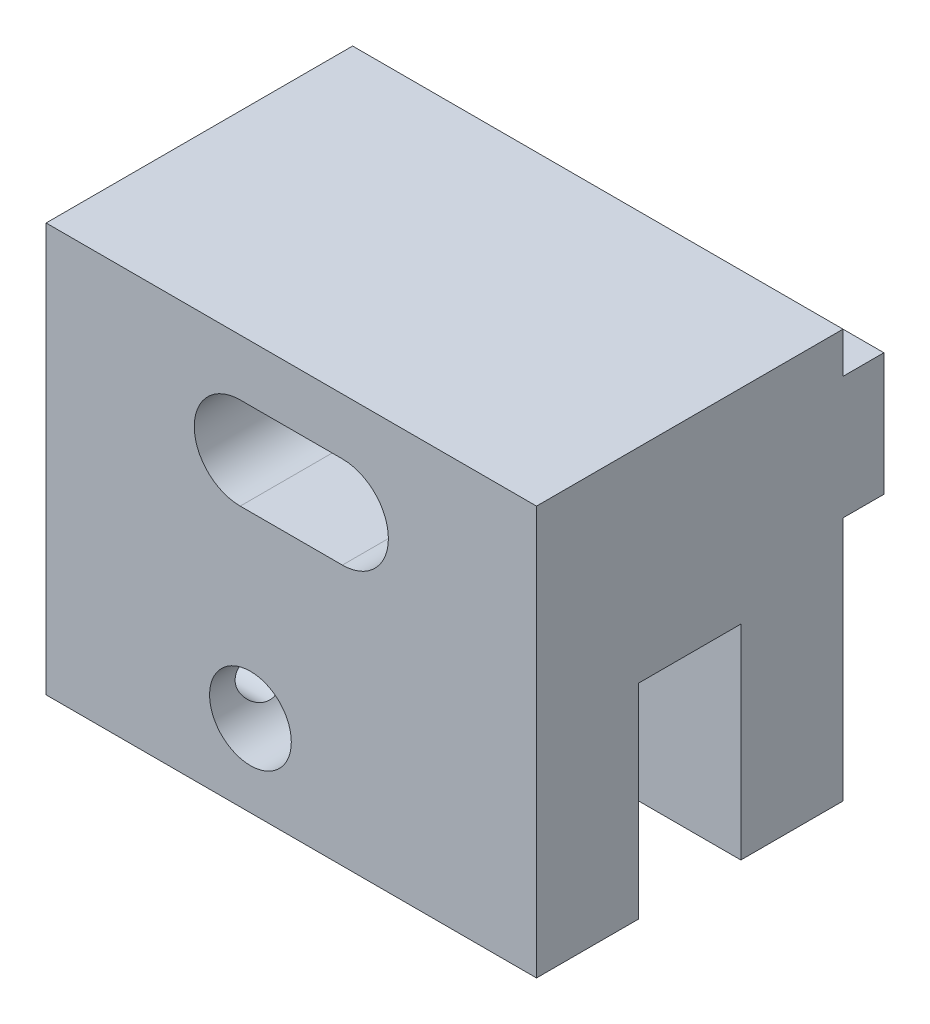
ISO-10303-21;
HEADER;
FILE_DESCRIPTION(('STEP AP214'),'2;1');
FILE_NAME('part.step','',(''),(''),'','','');
FILE_SCHEMA(('AUTOMOTIVE_DESIGN { 1 0 10303 214 1 1 1 1 }'));
ENDSEC;
DATA;
#1=APPLICATION_CONTEXT('core data for automotive mechanical design processes');
#2=APPLICATION_PROTOCOL_DEFINITION('international standard','automotive_design',2000,#1);
#3=PRODUCT_CONTEXT('',#1,'mechanical');
#4=PRODUCT('Part','Part','',(#3));
#5=PRODUCT_RELATED_PRODUCT_CATEGORY('part','',(#4));
#6=PRODUCT_DEFINITION_FORMATION('','',#4);
#7=PRODUCT_DEFINITION_CONTEXT('part definition',#1,'design');
#8=PRODUCT_DEFINITION('design','',#6,#7);
#9=PRODUCT_DEFINITION_SHAPE('','',#8);
#10=(LENGTH_UNIT() NAMED_UNIT(*) SI_UNIT(.MILLI.,.METRE.));
#11=(NAMED_UNIT(*) PLANE_ANGLE_UNIT() SI_UNIT($,.RADIAN.));
#12=(NAMED_UNIT(*) SI_UNIT($,.STERADIAN.) SOLID_ANGLE_UNIT());
#13=UNCERTAINTY_MEASURE_WITH_UNIT(LENGTH_MEASURE(1.E-05),#10,'distance_accuracy_value','');
#14=(GEOMETRIC_REPRESENTATION_CONTEXT(3) GLOBAL_UNCERTAINTY_ASSIGNED_CONTEXT((#13)) GLOBAL_UNIT_ASSIGNED_CONTEXT((#10,
#11,#12)) REPRESENTATION_CONTEXT('',''));
#15=CARTESIAN_POINT('',(0.,0.,0.));
#16=DIRECTION('',(0.,0.,1.));
#17=DIRECTION('',(1.,0.,0.));
#18=AXIS2_PLACEMENT_3D('',#15,#16,#17);
#19=CARTESIAN_POINT('',(0.,20.,0.));
#20=DIRECTION('',(0.,0.,-1.));
#21=DIRECTION('',(-1.,0.,0.));
#22=AXIS2_PLACEMENT_3D('',#19,#20,#21);
#23=PLANE('',#22);
#24=DIRECTION('',(-1.,0.,0.));
#25=VECTOR('',#24,1.);
#26=CARTESIAN_POINT('',(14.5,17.25,0.));
#27=LINE('',#26,#25);
#28=CARTESIAN_POINT('',(14.5,17.25,0.));
#29=VERTEX_POINT('',#28);
#30=CARTESIAN_POINT('',(9.5,17.25,0.));
#31=VERTEX_POINT('',#30);
#32=EDGE_CURVE('E230',#29,#31,#27,.T.);
#33=ORIENTED_EDGE('',*,*,#32,.T.);
#34=CARTESIAN_POINT('',(9.5,15.,0.));
#35=DIRECTION('',(0.,0.,1.));
#36=DIRECTION('',(1.,0.,0.));
#37=AXIS2_PLACEMENT_3D('',#34,#35,#36);
#38=CIRCLE('',#37,2.25);
#39=CARTESIAN_POINT('',(9.5,12.75,0.));
#40=VERTEX_POINT('',#39);
#41=EDGE_CURVE('E213',#31,#40,#38,.T.);
#42=ORIENTED_EDGE('',*,*,#41,.T.);
#43=DIRECTION('',(1.,0.,0.));
#44=VECTOR('',#43,1.);
#45=CARTESIAN_POINT('',(9.5,12.75,0.));
#46=LINE('',#45,#44);
#47=CARTESIAN_POINT('',(14.5,12.75,0.));
#48=VERTEX_POINT('',#47);
#49=EDGE_CURVE('E217',#40,#48,#46,.T.);
#50=ORIENTED_EDGE('',*,*,#49,.T.);
#51=CARTESIAN_POINT('',(14.5,15.,0.));
#52=DIRECTION('',(0.,0.,1.));
#53=DIRECTION('',(1.,0.,0.));
#54=AXIS2_PLACEMENT_3D('',#51,#52,#53);
#55=CIRCLE('',#54,2.25);
#56=EDGE_CURVE('E222',#48,#29,#55,.T.);
#57=ORIENTED_EDGE('',*,*,#56,.T.);
#58=EDGE_LOOP('',(#33,#42,#50,#57));
#59=FACE_BOUND('',#58,.T.);
#60=DIRECTION('',(0.,-1.,0.));
#61=VECTOR('',#60,1.);
#62=CARTESIAN_POINT('',(0.,0.,0.));
#63=LINE('',#62,#61);
#64=CARTESIAN_POINT('',(0.,17.9999999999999,0.));
#65=VERTEX_POINT('',#64);
#66=CARTESIAN_POINT('',(0.,11.9999999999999,0.));
#67=VERTEX_POINT('',#66);
#68=EDGE_CURVE('E188',#65,#67,#63,.T.);
#69=ORIENTED_EDGE('',*,*,#68,.F.);
#70=DIRECTION('',(1.,0.,0.));
#71=VECTOR('',#70,1.);
#72=CARTESIAN_POINT('',(0.,17.9999999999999,0.));
#73=LINE('',#72,#71);
#74=CARTESIAN_POINT('',(24.,17.9999999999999,0.));
#75=VERTEX_POINT('',#74);
#76=EDGE_CURVE('E315',#65,#75,#73,.T.);
#77=ORIENTED_EDGE('',*,*,#76,.T.);
#78=DIRECTION('',(0.,1.,0.));
#79=VECTOR('',#78,1.);
#80=CARTESIAN_POINT('',(24.,0.,0.));
#81=LINE('',#80,#79);
#82=CARTESIAN_POINT('',(24.,11.9999999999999,0.));
#83=VERTEX_POINT('',#82);
#84=EDGE_CURVE('E185',#83,#75,#81,.T.);
#85=ORIENTED_EDGE('',*,*,#84,.F.);
#86=DIRECTION('',(1.,0.,0.));
#87=VECTOR('',#86,1.);
#88=CARTESIAN_POINT('',(0.,11.9999999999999,0.));
#89=LINE('',#88,#87);
#90=EDGE_CURVE('E318',#67,#83,#89,.T.);
#91=ORIENTED_EDGE('',*,*,#90,.F.);
#92=EDGE_LOOP('',(#69,#77,#85,#91));
#93=FACE_BOUND('',#92,.T.);
#94=ADVANCED_FACE('F33',(#59,#93),#23,.T.);
#95=CARTESIAN_POINT('',(0.,0.,17.));
#96=DIRECTION('',(1.,0.,0.));
#97=DIRECTION('',(0.,0.,-1.));
#98=AXIS2_PLACEMENT_3D('',#95,#96,#97);
#99=PLANE('',#98);
#100=CARTESIAN_POINT('',(0.,3.99999999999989,14.5));
#101=DIRECTION('',(-1.,0.,0.));
#102=DIRECTION('',(0.,0.,1.));
#103=AXIS2_PLACEMENT_3D('',#100,#101,#102);
#104=CIRCLE('',#103,1.25);
#105=CARTESIAN_POINT('',(0.,3.99999999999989,15.75));
#106=VERTEX_POINT('',#105);
#107=EDGE_CURVE('E370',#106,#106,#104,.T.);
#108=ORIENTED_EDGE('',*,*,#107,.F.);
#109=EDGE_LOOP('',(#108));
#110=FACE_BOUND('',#109,.T.);
#111=CARTESIAN_POINT('',(0.,3.99999999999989,4.5));
#112=DIRECTION('',(-1.,0.,0.));
#113=DIRECTION('',(0.,0.,1.));
#114=AXIS2_PLACEMENT_3D('',#111,#112,#113);
#115=CIRCLE('',#114,1.25);
#116=CARTESIAN_POINT('',(0.,3.99999999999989,5.75));
#117=VERTEX_POINT('',#116);
#118=EDGE_CURVE('E369',#117,#117,#115,.T.);
#119=ORIENTED_EDGE('',*,*,#118,.F.);
#120=EDGE_LOOP('',(#119));
#121=FACE_BOUND('',#120,.T.);
#122=DIRECTION('',(0.,1.,0.));
#123=VECTOR('',#122,1.);
#124=CARTESIAN_POINT('',(0.,17.9999999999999,2.));
#125=LINE('',#124,#123);
#126=CARTESIAN_POINT('',(0.,17.9999999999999,2.));
#127=VERTEX_POINT('',#126);
#128=CARTESIAN_POINT('',(0.,20.,2.));
#129=VERTEX_POINT('',#128);
#130=EDGE_CURVE('E159',#127,#129,#125,.T.);
#131=ORIENTED_EDGE('',*,*,#130,.F.);
#132=DIRECTION('',(0.,0.,1.));
#133=VECTOR('',#132,1.);
#134=CARTESIAN_POINT('',(0.,17.9999999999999,2.));
#135=LINE('',#134,#133);
#136=EDGE_CURVE('E574',#65,#127,#135,.T.);
#137=ORIENTED_EDGE('',*,*,#136,.F.);
#138=ORIENTED_EDGE('',*,*,#68,.T.);
#139=DIRECTION('',(0.,0.,-1.));
#140=VECTOR('',#139,1.);
#141=CARTESIAN_POINT('',(0.,11.9999999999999,2.));
#142=LINE('',#141,#140);
#143=CARTESIAN_POINT('',(0.,11.9999999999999,2.));
#144=VERTEX_POINT('',#143);
#145=EDGE_CURVE('E573',#144,#67,#142,.T.);
#146=ORIENTED_EDGE('',*,*,#145,.F.);
#147=DIRECTION('',(0.,1.,0.));
#148=VECTOR('',#147,1.);
#149=CARTESIAN_POINT('',(0.,-1.13686837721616E-13,2.));
#150=LINE('',#149,#148);
#151=CARTESIAN_POINT('',(0.,-1.13686837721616E-13,2.));
#152=VERTEX_POINT('',#151);
#153=EDGE_CURVE('E577',#152,#144,#150,.T.);
#154=ORIENTED_EDGE('',*,*,#153,.F.);
#155=DIRECTION('',(0.,0.,-1.));
#156=VECTOR('',#155,1.);
#157=CARTESIAN_POINT('',(0.,0.,17.));
#158=LINE('',#157,#156);
#159=CARTESIAN_POINT('',(0.,-1.13686837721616E-13,7.));
#160=VERTEX_POINT('',#159);
#161=EDGE_CURVE('E42',#160,#152,#158,.T.);
#162=ORIENTED_EDGE('',*,*,#161,.F.);
#163=DIRECTION('',(0.,-1.,0.));
#164=VECTOR('',#163,1.);
#165=CARTESIAN_POINT('',(0.,-1.13686837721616E-13,7.));
#166=LINE('',#165,#164);
#167=CARTESIAN_POINT('',(0.,9.99999999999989,7.));
#168=VERTEX_POINT('',#167);
#169=EDGE_CURVE('E581',#168,#160,#166,.T.);
#170=ORIENTED_EDGE('',*,*,#169,.F.);
#171=DIRECTION('',(0.,0.,-1.));
#172=VECTOR('',#171,1.);
#173=CARTESIAN_POINT('',(0.,9.99999999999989,12.));
#174=LINE('',#173,#172);
#175=CARTESIAN_POINT('',(0.,9.99999999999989,12.));
#176=VERTEX_POINT('',#175);
#177=EDGE_CURVE('E167',#176,#168,#174,.T.);
#178=ORIENTED_EDGE('',*,*,#177,.F.);
#179=DIRECTION('',(0.,1.,0.));
#180=VECTOR('',#179,1.);
#181=CARTESIAN_POINT('',(0.,-1.13686837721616E-13,12.));
#182=LINE('',#181,#180);
#183=CARTESIAN_POINT('',(0.,-1.13686837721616E-13,12.));
#184=VERTEX_POINT('',#183);
#185=EDGE_CURVE('E151',#184,#176,#182,.T.);
#186=ORIENTED_EDGE('',*,*,#185,.F.);
#187=CARTESIAN_POINT('',(0.,0.,17.));
#188=VERTEX_POINT('',#187);
#189=EDGE_CURVE('E12',#188,#184,#158,.T.);
#190=ORIENTED_EDGE('',*,*,#189,.F.);
#191=DIRECTION('',(0.,-1.,0.));
#192=VECTOR('',#191,1.);
#193=CARTESIAN_POINT('',(0.,0.,17.));
#194=LINE('',#193,#192);
#195=CARTESIAN_POINT('',(0.,20.,17.));
#196=VERTEX_POINT('',#195);
#197=EDGE_CURVE('E177',#196,#188,#194,.T.);
#198=ORIENTED_EDGE('',*,*,#197,.F.);
#199=DIRECTION('',(0.,0.,-1.));
#200=VECTOR('',#199,1.);
#201=CARTESIAN_POINT('',(0.,20.,17.));
#202=LINE('',#201,#200);
#203=EDGE_CURVE('E196',#196,#129,#202,.T.);
#204=ORIENTED_EDGE('',*,*,#203,.T.);
#205=EDGE_LOOP('',(#131,#137,#138,#146,#154,#162,#170,#178,#186,#190,#198,#204));
#206=FACE_BOUND('',#205,.T.);
#207=ADVANCED_FACE('F35',(#110,#121,#206),#99,.F.);
#208=CARTESIAN_POINT('',(0.,0.,17.));
#209=DIRECTION('',(0.,1.,0.));
#210=DIRECTION('',(0.,0.,1.));
#211=AXIS2_PLACEMENT_3D('',#208,#209,#210);
#212=PLANE('',#211);
#213=DIRECTION('',(1.,0.,0.));
#214=VECTOR('',#213,1.);
#215=CARTESIAN_POINT('',(0.,-1.13686837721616E-13,2.));
#216=LINE('',#215,#214);
#217=CARTESIAN_POINT('',(24.,-1.13686837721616E-13,2.));
#218=VERTEX_POINT('',#217);
#219=EDGE_CURVE('E285',#152,#218,#216,.T.);
#220=ORIENTED_EDGE('',*,*,#219,.T.);
#221=DIRECTION('',(0.,0.,-1.));
#222=VECTOR('',#221,1.);
#223=CARTESIAN_POINT('',(24.,0.,17.));
#224=LINE('',#223,#222);
#225=CARTESIAN_POINT('',(24.,-1.13686837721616E-13,7.));
#226=VERTEX_POINT('',#225);
#227=EDGE_CURVE('E203',#226,#218,#224,.T.);
#228=ORIENTED_EDGE('',*,*,#227,.F.);
#229=DIRECTION('',(1.,0.,0.));
#230=VECTOR('',#229,1.);
#231=CARTESIAN_POINT('',(0.,-1.13686837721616E-13,7.));
#232=LINE('',#231,#230);
#233=EDGE_CURVE('E293',#160,#226,#232,.T.);
#234=ORIENTED_EDGE('',*,*,#233,.F.);
#235=ORIENTED_EDGE('',*,*,#161,.T.);
#236=EDGE_LOOP('',(#220,#228,#234,#235));
#237=FACE_BOUND('',#236,.T.);
#238=ADVANCED_FACE('F267',(#237),#212,.F.);
#239=DIRECTION('',(1.,0.,0.));
#240=VECTOR('',#239,1.);
#241=CARTESIAN_POINT('',(0.,-1.13686837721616E-13,12.));
#242=LINE('',#241,#240);
#243=CARTESIAN_POINT('',(24.,-1.14491749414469E-13,12.));
#244=VERTEX_POINT('',#243);
#245=EDGE_CURVE('E148',#184,#244,#242,.T.);
#246=ORIENTED_EDGE('',*,*,#245,.T.);
#247=CARTESIAN_POINT('',(24.,0.,17.));
#248=VERTEX_POINT('',#247);
#249=EDGE_CURVE('E173',#248,#244,#224,.T.);
#250=ORIENTED_EDGE('',*,*,#249,.F.);
#251=DIRECTION('',(1.,0.,0.));
#252=VECTOR('',#251,1.);
#253=CARTESIAN_POINT('',(0.,0.,17.));
#254=LINE('',#253,#252);
#255=EDGE_CURVE('E171',#188,#248,#254,.T.);
#256=ORIENTED_EDGE('',*,*,#255,.F.);
#257=ORIENTED_EDGE('',*,*,#189,.T.);
#258=EDGE_LOOP('',(#246,#250,#256,#257));
#259=FACE_BOUND('',#258,.T.);
#260=ADVANCED_FACE('F170',(#259),#212,.F.);
#261=CARTESIAN_POINT('',(24.,0.,17.));
#262=DIRECTION('',(-1.,0.,0.));
#263=DIRECTION('',(0.,0.,1.));
#264=AXIS2_PLACEMENT_3D('',#261,#262,#263);
#265=PLANE('',#264);
#266=DIRECTION('',(0.,1.,0.));
#267=VECTOR('',#266,1.);
#268=CARTESIAN_POINT('',(24.,17.9999999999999,2.));
#269=LINE('',#268,#267);
#270=CARTESIAN_POINT('',(24.,17.9999999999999,2.));
#271=VERTEX_POINT('',#270);
#272=CARTESIAN_POINT('',(24.,19.9999999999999,2.));
#273=VERTEX_POINT('',#272);
#274=EDGE_CURVE('E168',#271,#273,#269,.T.);
#275=ORIENTED_EDGE('',*,*,#274,.T.);
#276=DIRECTION('',(0.,0.,-1.));
#277=VECTOR('',#276,1.);
#278=CARTESIAN_POINT('',(24.,20.,17.));
#279=LINE('',#278,#277);
#280=CARTESIAN_POINT('',(24.,20.,17.));
#281=VERTEX_POINT('',#280);
#282=EDGE_CURVE('E200',#281,#273,#279,.T.);
#283=ORIENTED_EDGE('',*,*,#282,.F.);
#284=DIRECTION('',(0.,1.,0.));
#285=VECTOR('',#284,1.);
#286=CARTESIAN_POINT('',(24.,0.,17.));
#287=LINE('',#286,#285);
#288=EDGE_CURVE('E176',#248,#281,#287,.T.);
#289=ORIENTED_EDGE('',*,*,#288,.F.);
#290=ORIENTED_EDGE('',*,*,#249,.T.);
#291=DIRECTION('',(0.,1.,0.));
#292=VECTOR('',#291,1.);
#293=CARTESIAN_POINT('',(24.,-1.13686837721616E-13,12.));
#294=LINE('',#293,#292);
#295=CARTESIAN_POINT('',(24.,9.99999999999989,12.));
#296=VERTEX_POINT('',#295);
#297=EDGE_CURVE('E154',#244,#296,#294,.T.);
#298=ORIENTED_EDGE('',*,*,#297,.T.);
#299=DIRECTION('',(0.,0.,-1.));
#300=VECTOR('',#299,1.);
#301=CARTESIAN_POINT('',(24.,9.99999999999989,12.));
#302=LINE('',#301,#300);
#303=CARTESIAN_POINT('',(24.,9.99999999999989,7.));
#304=VERTEX_POINT('',#303);
#305=EDGE_CURVE('E58',#296,#304,#302,.T.);
#306=ORIENTED_EDGE('',*,*,#305,.T.);
#307=DIRECTION('',(0.,-1.,0.));
#308=VECTOR('',#307,1.);
#309=CARTESIAN_POINT('',(24.,-1.13686837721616E-13,7.));
#310=LINE('',#309,#308);
#311=EDGE_CURVE('E300',#304,#226,#310,.T.);
#312=ORIENTED_EDGE('',*,*,#311,.T.);
#313=ORIENTED_EDGE('',*,*,#227,.T.);
#314=DIRECTION('',(0.,1.,0.));
#315=VECTOR('',#314,1.);
#316=CARTESIAN_POINT('',(24.,-1.13686837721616E-13,2.));
#317=LINE('',#316,#315);
#318=CARTESIAN_POINT('',(24.,11.9999999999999,2.));
#319=VERTEX_POINT('',#318);
#320=EDGE_CURVE('E298',#218,#319,#317,.T.);
#321=ORIENTED_EDGE('',*,*,#320,.T.);
#322=DIRECTION('',(0.,0.,-1.));
#323=VECTOR('',#322,1.);
#324=CARTESIAN_POINT('',(24.,11.9999999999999,2.));
#325=LINE('',#324,#323);
#326=EDGE_CURVE('E50',#319,#83,#325,.T.);
#327=ORIENTED_EDGE('',*,*,#326,.T.);
#328=ORIENTED_EDGE('',*,*,#84,.T.);
#329=DIRECTION('',(0.,0.,1.));
#330=VECTOR('',#329,1.);
#331=CARTESIAN_POINT('',(24.,17.9999999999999,2.));
#332=LINE('',#331,#330);
#333=EDGE_CURVE('E308',#75,#271,#332,.T.);
#334=ORIENTED_EDGE('',*,*,#333,.T.);
#335=EDGE_LOOP('',(#275,#283,#289,#290,#298,#306,#312,#313,#321,#327,#328,#334));
#336=FACE_BOUND('',#335,.T.);
#337=ADVANCED_FACE('F273',(#336),#265,.F.);
#338=CARTESIAN_POINT('',(0.,20.,17.));
#339=DIRECTION('',(0.,-1.,0.));
#340=DIRECTION('',(0.,0.,-1.));
#341=AXIS2_PLACEMENT_3D('',#338,#339,#340);
#342=PLANE('',#341);
#343=DIRECTION('',(1.,0.,0.));
#344=VECTOR('',#343,1.);
#345=CARTESIAN_POINT('',(0.,19.9999999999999,2.));
#346=LINE('',#345,#344);
#347=EDGE_CURVE('E208',#129,#273,#346,.T.);
#348=ORIENTED_EDGE('',*,*,#347,.F.);
#349=ORIENTED_EDGE('',*,*,#203,.F.);
#350=DIRECTION('',(-1.,0.,0.));
#351=VECTOR('',#350,1.);
#352=CARTESIAN_POINT('',(0.,20.,17.));
#353=LINE('',#352,#351);
#354=EDGE_CURVE('E182',#281,#196,#353,.T.);
#355=ORIENTED_EDGE('',*,*,#354,.F.);
#356=ORIENTED_EDGE('',*,*,#282,.T.);
#357=EDGE_LOOP('',(#348,#349,#355,#356));
#358=FACE_BOUND('',#357,.T.);
#359=ADVANCED_FACE('F258',(#358),#342,.F.);
#360=CARTESIAN_POINT('',(10.,4.,17.));
#361=DIRECTION('',(0.,0.,-1.));
#362=DIRECTION('',(-1.,0.,0.));
#363=AXIS2_PLACEMENT_3D('',#360,#361,#362);
#364=CYLINDRICAL_SURFACE('',#363,2.);
#365=CARTESIAN_POINT('',(8.,3.99999999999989,15.75));
#366=CARTESIAN_POINT('',(8.00000404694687,4.06351047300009,15.7499956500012));
#367=CARTESIAN_POINT('',(8.00305676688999,4.12709644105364,15.7451269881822));
#368=CARTESIAN_POINT('',(8.01497832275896,4.25231826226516,15.7259141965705));
#369=CARTESIAN_POINT('',(8.02385824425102,4.31395016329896,15.7115520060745));
#370=CARTESIAN_POINT('',(8.04654147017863,4.43320555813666,15.6741886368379));
#371=CARTESIAN_POINT('',(8.06032039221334,4.4908472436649,15.6512302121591));
#372=CARTESIAN_POINT('',(8.09165401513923,4.60126036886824,15.5976141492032));
#373=CARTESIAN_POINT('',(8.10920829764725,4.65403234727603,15.5669573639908));
#374=CARTESIAN_POINT('',(8.14829847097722,4.75797419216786,15.496113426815));
#375=CARTESIAN_POINT('',(8.17004037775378,4.80867956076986,15.4553607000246));
#376=CARTESIAN_POINT('',(8.21468650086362,4.90298637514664,15.3667808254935));
#377=CARTESIAN_POINT('',(8.23759225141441,4.94657810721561,15.3189441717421));
#378=CARTESIAN_POINT('',(8.28569581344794,5.0314287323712,15.2099661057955));
#379=CARTESIAN_POINT('',(8.3107838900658,5.07157206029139,15.1479002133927));
#380=CARTESIAN_POINT('',(8.3566980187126,5.14073966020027,15.0164351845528));
#381=CARTESIAN_POINT('',(8.37753124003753,5.16978270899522,14.9470486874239));
#382=CARTESIAN_POINT('',(8.40690424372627,5.20933400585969,14.8211894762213));
#383=CARTESIAN_POINT('',(8.41723094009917,5.22269552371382,14.7660331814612));
#384=CARTESIAN_POINT('',(8.43218642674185,5.24181843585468,14.6536940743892));
#385=CARTESIAN_POINT('',(8.43682326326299,5.24759056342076,14.5965142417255));
#386=CARTESIAN_POINT('',(8.43970114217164,5.25118918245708,14.4815869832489));
#387=CARTESIAN_POINT('',(8.43792541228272,5.2489948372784,14.4238384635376));
#388=CARTESIAN_POINT('',(8.42822597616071,5.23676317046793,14.309689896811));
#389=CARTESIAN_POINT('',(8.42029734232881,5.22671956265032,14.2532909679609));
#390=CARTESIAN_POINT('',(8.3996742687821,5.19968103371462,14.1445615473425));
#391=CARTESIAN_POINT('',(8.38709284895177,5.18285016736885,14.0921675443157));
#392=CARTESIAN_POINT('',(8.35854433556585,5.14290189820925,13.9908388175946));
#393=CARTESIAN_POINT('',(8.34257604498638,5.11978227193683,13.9419053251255));
#394=CARTESIAN_POINT('',(8.30545184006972,5.06294892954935,13.8391667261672));
#395=CARTESIAN_POINT('',(8.28388408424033,5.02806296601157,13.7861591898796));
#396=CARTESIAN_POINT('',(8.23994288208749,4.95088146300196,13.6861697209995));
#397=CARTESIAN_POINT('',(8.21756862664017,4.90857830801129,13.6391940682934));
#398=CARTESIAN_POINT('',(8.17020105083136,4.80951971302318,13.5446982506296));
#399=CARTESIAN_POINT('',(8.14538468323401,4.75153135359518,13.4983670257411));
#400=CARTESIAN_POINT('',(8.0997194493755,4.62714809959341,13.4161491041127));
#401=CARTESIAN_POINT('',(8.07886902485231,4.56075652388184,13.3802583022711));
#402=CARTESIAN_POINT('',(8.0444662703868,4.42488356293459,13.3222363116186));
#403=CARTESIAN_POINT('',(8.03058023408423,4.35576345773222,13.2994659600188));
#404=CARTESIAN_POINT('',(8.0101507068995,4.21361215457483,13.2662350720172));
#405=CARTESIAN_POINT('',(8.00359682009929,4.14058664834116,13.255757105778));
#406=CARTESIAN_POINT('',(7.99902159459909,4.00451561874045,13.2484341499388));
#407=CARTESIAN_POINT('',(7.9998783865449,3.94159722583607,13.2497968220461));
#408=CARTESIAN_POINT('',(8.00741098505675,3.81702788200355,13.2618828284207));
#409=CARTESIAN_POINT('',(8.0140863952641,3.75537684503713,13.2726055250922));
#410=CARTESIAN_POINT('',(8.03225947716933,3.63747892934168,13.302238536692));
#411=CARTESIAN_POINT('',(8.04355829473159,3.58111499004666,13.3208121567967));
#412=CARTESIAN_POINT('',(8.07004315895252,3.47236171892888,13.3652963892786));
#413=CARTESIAN_POINT('',(8.08522985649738,3.41997305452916,13.3912082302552));
#414=CARTESIAN_POINT('',(8.12009987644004,3.31491594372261,13.4525152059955));
#415=CARTESIAN_POINT('',(8.14008235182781,3.26275303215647,13.4886035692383));
#416=CARTESIAN_POINT('',(8.18193029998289,3.16485735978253,13.5677938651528));
#417=CARTESIAN_POINT('',(8.20379785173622,3.11913184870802,13.6109035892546));
#418=CARTESIAN_POINT('',(8.25094130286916,3.02852580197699,13.7101350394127));
#419=CARTESIAN_POINT('',(8.27625116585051,2.98473148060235,13.7672372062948));
#420=CARTESIAN_POINT('',(8.32433237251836,2.90719648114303,13.8888757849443));
#421=CARTESIAN_POINT('',(8.34710546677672,2.87344884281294,13.953407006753));
#422=CARTESIAN_POINT('',(8.38266469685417,2.8231522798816,14.0746921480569));
#423=CARTESIAN_POINT('',(8.39654363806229,2.80448104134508,14.1302407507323));
#424=CARTESIAN_POINT('',(8.41894969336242,2.77499891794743,14.2443931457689));
#425=CARTESIAN_POINT('',(8.42748516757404,2.76417575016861,14.3029920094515));
#426=CARTESIAN_POINT('',(8.43793675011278,2.75098616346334,14.4220902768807));
#427=CARTESIAN_POINT('',(8.4398149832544,2.74866813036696,14.4825985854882));
#428=CARTESIAN_POINT('',(8.43650936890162,2.75280221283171,14.603130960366));
#429=CARTESIAN_POINT('',(8.43132317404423,2.75925724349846,14.6631548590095));
#430=CARTESIAN_POINT('',(8.41544611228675,2.77961727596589,14.7760297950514));
#431=CARTESIAN_POINT('',(8.40523191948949,2.79288080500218,14.8290693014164));
#432=CARTESIAN_POINT('',(8.38082469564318,2.82582376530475,14.9321350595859));
#433=CARTESIAN_POINT('',(8.36663000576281,2.84550587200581,14.9821600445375));
#434=CARTESIAN_POINT('',(8.3333609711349,2.89397309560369,15.0855967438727));
#435=CARTESIAN_POINT('',(8.31387769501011,2.92366355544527,15.1384502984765));
#436=CARTESIAN_POINT('',(8.2733229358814,2.98999982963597,15.238938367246));
#437=CARTESIAN_POINT('',(8.25225017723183,3.02665126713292,15.2865686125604));
#438=CARTESIAN_POINT('',(8.20598089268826,3.11432977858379,15.3850142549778));
#439=CARTESIAN_POINT('',(8.18079458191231,3.16676632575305,15.4345908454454));
#440=CARTESIAN_POINT('',(8.13301270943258,3.28017755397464,15.5244948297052));
#441=CARTESIAN_POINT('',(8.11041875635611,3.34115748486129,15.5648164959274));
#442=CARTESIAN_POINT('',(8.07013289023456,3.47064460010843,15.6347711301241));
#443=CARTESIAN_POINT('',(8.05244928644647,3.53916427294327,15.6643860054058));
#444=CARTESIAN_POINT('',(8.0241847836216,3.68160528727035,15.7110718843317));
#445=CARTESIAN_POINT('',(8.01357878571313,3.755506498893,15.7281872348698));
#446=CARTESIAN_POINT('',(8.00480527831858,3.85858151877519,15.7422992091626));
#447=CARTESIAN_POINT('',(8.00300827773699,3.88675139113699,15.745181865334));
#448=CARTESIAN_POINT('',(8.00060469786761,3.94327581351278,15.7490332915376));
#449=CARTESIAN_POINT('',(7.99999819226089,3.97163037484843,15.75000194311));
#450=CARTESIAN_POINT('',(8.,3.99999999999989,15.75));
#451=B_SPLINE_CURVE_WITH_KNOTS('',3,(#365,#366,#367,#368,#369,#370,#371,#372,#373,#374,#375,
#376,#377,#378,#379,#380,#381,#382,#383,#384,#385,#386,#387,#388,#389,#390,#391,#392,#393,#394,
#395,#396,#397,#398,#399,#400,#401,#402,#403,#404,#405,#406,#407,#408,#409,#410,#411,#412,#413,
#414,#415,#416,#417,#418,#419,#420,#421,#422,#423,#424,#425,#426,#427,#428,#429,#430,#431,#432,
#433,#434,#435,#436,#437,#438,#439,#440,#441,#442,#443,#444,#445,#446,#447,#448,#449,#450),
.UNSPECIFIED.,.T.,.F.,(4,2,2,2,2,2,2,2,2,2,2,2,2,2,2,2,2,2,2,2,2,2,2,2,2,2,2,2,2,2,2,2,2,2,2,2,
2,2,2,2,2,2,4),(0.,0.190412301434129,0.381187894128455,0.571026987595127,0.760845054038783,
0.965821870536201,1.17107628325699,1.4041297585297,1.63678724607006,1.80912008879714,
1.98120894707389,2.15374823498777,2.32642584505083,2.49515839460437,2.66395067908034,
2.86427450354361,3.06480522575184,3.29842180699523,3.53194640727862,3.75284174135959,
3.97342347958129,4.16127180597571,4.34910733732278,4.52959504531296,4.71011298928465,
4.90885230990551,5.10781368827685,5.33565708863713,5.56334227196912,5.7432994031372,
5.92297427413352,6.10366974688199,6.28442527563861,6.45063169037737,6.61690747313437,
6.80725523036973,6.99775741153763,7.22600539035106,7.45439424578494,7.68316725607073,
7.91112460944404,7.99617501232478,8.08123067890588),.UNSPECIFIED.);
#452=CARTESIAN_POINT('',(8.,3.99999999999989,15.75));
#453=VERTEX_POINT('',#452);
#454=EDGE_CURVE('E375',#453,#453,#451,.T.);
#455=ORIENTED_EDGE('',*,*,#454,.T.);
#456=EDGE_LOOP('',(#455));
#457=FACE_BOUND('',#456,.T.);
#458=CARTESIAN_POINT('',(10.,4.,17.));
#459=DIRECTION('',(0.,0.,1.));
#460=DIRECTION('',(1.,0.,0.));
#461=AXIS2_PLACEMENT_3D('',#458,#459,#460);
#462=CIRCLE('',#461,2.);
#463=CARTESIAN_POINT('',(12.,4.,17.));
#464=VERTEX_POINT('',#463);
#465=EDGE_CURVE('E191',#464,#464,#462,.T.);
#466=ORIENTED_EDGE('',*,*,#465,.T.);
#467=EDGE_LOOP('',(#466));
#468=FACE_BOUND('',#467,.T.);
#469=CARTESIAN_POINT('',(10.,4.,12.));
#470=DIRECTION('',(0.,0.,-1.));
#471=DIRECTION('',(-1.,0.,0.));
#472=AXIS2_PLACEMENT_3D('',#469,#470,#471);
#473=CIRCLE('',#472,2.);
#474=CARTESIAN_POINT('',(8.,4.,12.));
#475=VERTEX_POINT('',#474);
#476=EDGE_CURVE('E205',#475,#475,#473,.T.);
#477=ORIENTED_EDGE('',*,*,#476,.T.);
#478=EDGE_LOOP('',(#477));
#479=FACE_BOUND('',#478,.T.);
#480=ADVANCED_FACE('F246',(#457,#468,#479),#364,.F.);
#481=CARTESIAN_POINT('',(0.,20.,17.));
#482=DIRECTION('',(0.,0.,-1.));
#483=DIRECTION('',(-1.,0.,0.));
#484=AXIS2_PLACEMENT_3D('',#481,#482,#483);
#485=PLANE('',#484);
#486=ORIENTED_EDGE('',*,*,#465,.F.);
#487=EDGE_LOOP('',(#486));
#488=FACE_BOUND('',#487,.T.);
#489=ORIENTED_EDGE('',*,*,#197,.T.);
#490=ORIENTED_EDGE('',*,*,#255,.T.);
#491=ORIENTED_EDGE('',*,*,#288,.T.);
#492=ORIENTED_EDGE('',*,*,#354,.T.);
#493=EDGE_LOOP('',(#489,#490,#491,#492));
#494=FACE_BOUND('',#493,.T.);
#495=CARTESIAN_POINT('',(9.5,15.,17.));
#496=DIRECTION('',(0.,0.,1.));
#497=DIRECTION('',(1.,0.,0.));
#498=AXIS2_PLACEMENT_3D('',#495,#496,#497);
#499=CIRCLE('',#498,2.25);
#500=CARTESIAN_POINT('',(9.5,17.25,17.));
#501=VERTEX_POINT('',#500);
#502=CARTESIAN_POINT('',(9.5,12.75,17.));
#503=VERTEX_POINT('',#502);
#504=EDGE_CURVE('E232',#501,#503,#499,.T.);
#505=ORIENTED_EDGE('',*,*,#504,.F.);
#506=DIRECTION('',(-1.,0.,0.));
#507=VECTOR('',#506,1.);
#508=CARTESIAN_POINT('',(14.5,17.25,17.));
#509=LINE('',#508,#507);
#510=CARTESIAN_POINT('',(14.5,17.25,17.));
#511=VERTEX_POINT('',#510);
#512=EDGE_CURVE('E225',#511,#501,#509,.T.);
#513=ORIENTED_EDGE('',*,*,#512,.F.);
#514=CARTESIAN_POINT('',(14.5,15.,17.));
#515=DIRECTION('',(0.,0.,1.));
#516=DIRECTION('',(1.,0.,0.));
#517=AXIS2_PLACEMENT_3D('',#514,#515,#516);
#518=CIRCLE('',#517,2.25);
#519=CARTESIAN_POINT('',(14.5,12.75,17.));
#520=VERTEX_POINT('',#519);
#521=EDGE_CURVE('E327',#520,#511,#518,.T.);
#522=ORIENTED_EDGE('',*,*,#521,.F.);
#523=DIRECTION('',(1.,0.,0.));
#524=VECTOR('',#523,1.);
#525=CARTESIAN_POINT('',(9.5,12.75,17.));
#526=LINE('',#525,#524);
#527=EDGE_CURVE('E326',#503,#520,#526,.T.);
#528=ORIENTED_EDGE('',*,*,#527,.F.);
#529=EDGE_LOOP('',(#505,#513,#522,#528));
#530=FACE_BOUND('',#529,.T.);
#531=ADVANCED_FACE('F179',(#488,#494,#530),#485,.F.);
#532=CARTESIAN_POINT('',(9.5,15.,17.));
#533=DIRECTION('',(0.,0.,-1.));
#534=DIRECTION('',(-1.,0.,0.));
#535=AXIS2_PLACEMENT_3D('',#532,#533,#534);
#536=CYLINDRICAL_SURFACE('',#535,2.25);
#537=ORIENTED_EDGE('',*,*,#41,.F.);
#538=DIRECTION('',(0.,0.,-1.));
#539=VECTOR('',#538,1.);
#540=CARTESIAN_POINT('',(9.5,17.25,17.));
#541=LINE('',#540,#539);
#542=EDGE_CURVE('E233',#501,#31,#541,.T.);
#543=ORIENTED_EDGE('',*,*,#542,.F.);
#544=ORIENTED_EDGE('',*,*,#504,.T.);
#545=DIRECTION('',(0.,0.,-1.));
#546=VECTOR('',#545,1.);
#547=CARTESIAN_POINT('',(9.5,12.75,17.));
#548=LINE('',#547,#546);
#549=EDGE_CURVE('E239',#503,#40,#548,.T.);
#550=ORIENTED_EDGE('',*,*,#549,.T.);
#551=EDGE_LOOP('',(#537,#543,#544,#550));
#552=FACE_BOUND('',#551,.T.);
#553=ADVANCED_FACE('F250',(#552),#536,.F.);
#554=CARTESIAN_POINT('',(9.5,12.75,17.));
#555=DIRECTION('',(0.,1.,0.));
#556=DIRECTION('',(0.,0.,1.));
#557=AXIS2_PLACEMENT_3D('',#554,#555,#556);
#558=PLANE('',#557);
#559=ORIENTED_EDGE('',*,*,#49,.F.);
#560=ORIENTED_EDGE('',*,*,#549,.F.);
#561=ORIENTED_EDGE('',*,*,#527,.T.);
#562=DIRECTION('',(0.,0.,-1.));
#563=VECTOR('',#562,1.);
#564=CARTESIAN_POINT('',(14.5,12.75,17.));
#565=LINE('',#564,#563);
#566=EDGE_CURVE('E238',#520,#48,#565,.T.);
#567=ORIENTED_EDGE('',*,*,#566,.T.);
#568=EDGE_LOOP('',(#559,#560,#561,#567));
#569=FACE_BOUND('',#568,.T.);
#570=ADVANCED_FACE('F256',(#569),#558,.T.);
#571=CARTESIAN_POINT('',(14.5,15.,17.));
#572=DIRECTION('',(0.,0.,-1.));
#573=DIRECTION('',(-1.,0.,0.));
#574=AXIS2_PLACEMENT_3D('',#571,#572,#573);
#575=CYLINDRICAL_SURFACE('',#574,2.25);
#576=ORIENTED_EDGE('',*,*,#56,.F.);
#577=ORIENTED_EDGE('',*,*,#566,.F.);
#578=ORIENTED_EDGE('',*,*,#521,.T.);
#579=DIRECTION('',(0.,0.,-1.));
#580=VECTOR('',#579,1.);
#581=CARTESIAN_POINT('',(14.5,17.25,17.));
#582=LINE('',#581,#580);
#583=EDGE_CURVE('E236',#511,#29,#582,.T.);
#584=ORIENTED_EDGE('',*,*,#583,.T.);
#585=EDGE_LOOP('',(#576,#577,#578,#584));
#586=FACE_BOUND('',#585,.T.);
#587=ADVANCED_FACE('F341',(#586),#575,.F.);
#588=CARTESIAN_POINT('',(14.5,17.25,17.));
#589=DIRECTION('',(0.,-1.,0.));
#590=DIRECTION('',(0.,0.,-1.));
#591=AXIS2_PLACEMENT_3D('',#588,#589,#590);
#592=PLANE('',#591);
#593=ORIENTED_EDGE('',*,*,#32,.F.);
#594=ORIENTED_EDGE('',*,*,#583,.F.);
#595=ORIENTED_EDGE('',*,*,#512,.T.);
#596=ORIENTED_EDGE('',*,*,#542,.T.);
#597=EDGE_LOOP('',(#593,#594,#595,#596));
#598=FACE_BOUND('',#597,.T.);
#599=ADVANCED_FACE('F336',(#598),#592,.T.);
#600=CARTESIAN_POINT('',(0.,-1.13686837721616E-13,12.));
#601=DIRECTION('',(0.,0.,-1.));
#602=DIRECTION('',(-1.,0.,0.));
#603=AXIS2_PLACEMENT_3D('',#600,#601,#602);
#604=PLANE('',#603);
#605=ORIENTED_EDGE('',*,*,#476,.F.);
#606=EDGE_LOOP('',(#605));
#607=FACE_BOUND('',#606,.T.);
#608=ORIENTED_EDGE('',*,*,#297,.F.);
#609=ORIENTED_EDGE('',*,*,#245,.F.);
#610=ORIENTED_EDGE('',*,*,#185,.T.);
#611=DIRECTION('',(1.,0.,0.));
#612=VECTOR('',#611,1.);
#613=CARTESIAN_POINT('',(0.,9.99999999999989,12.));
#614=LINE('',#613,#612);
#615=EDGE_CURVE('E158',#176,#296,#614,.T.);
#616=ORIENTED_EDGE('',*,*,#615,.T.);
#617=EDGE_LOOP('',(#608,#609,#610,#616));
#618=FACE_BOUND('',#617,.T.);
#619=ADVANCED_FACE('F150',(#607,#618),#604,.T.);
#620=CARTESIAN_POINT('',(0.,-1.13686837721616E-13,7.));
#621=DIRECTION('',(0.,0.,1.));
#622=DIRECTION('',(1.,0.,0.));
#623=AXIS2_PLACEMENT_3D('',#620,#621,#622);
#624=PLANE('',#623);
#625=CARTESIAN_POINT('',(10.,4.,7.));
#626=DIRECTION('',(0.,0.,1.));
#627=DIRECTION('',(1.,0.,0.));
#628=AXIS2_PLACEMENT_3D('',#625,#626,#627);
#629=CIRCLE('',#628,2.);
#630=CARTESIAN_POINT('',(12.,4.,7.));
#631=VERTEX_POINT('',#630);
#632=EDGE_CURVE('E207',#631,#631,#629,.T.);
#633=ORIENTED_EDGE('',*,*,#632,.F.);
#634=EDGE_LOOP('',(#633));
#635=FACE_BOUND('',#634,.T.);
#636=ORIENTED_EDGE('',*,*,#311,.F.);
#637=DIRECTION('',(1.,0.,0.));
#638=VECTOR('',#637,1.);
#639=CARTESIAN_POINT('',(0.,9.99999999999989,7.));
#640=LINE('',#639,#638);
#641=EDGE_CURVE('E322',#168,#304,#640,.T.);
#642=ORIENTED_EDGE('',*,*,#641,.F.);
#643=ORIENTED_EDGE('',*,*,#169,.T.);
#644=ORIENTED_EDGE('',*,*,#233,.T.);
#645=EDGE_LOOP('',(#636,#642,#643,#644));
#646=FACE_BOUND('',#645,.T.);
#647=ADVANCED_FACE('F362',(#635,#646),#624,.T.);
#648=CARTESIAN_POINT('',(0.,9.99999999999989,12.));
#649=DIRECTION('',(0.,-1.,0.));
#650=DIRECTION('',(0.,0.,-1.));
#651=AXIS2_PLACEMENT_3D('',#648,#649,#650);
#652=PLANE('',#651);
#653=CARTESIAN_POINT('',(20.,9.99999999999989,9.5));
#654=DIRECTION('',(0.,-1.,0.));
#655=DIRECTION('',(0.,0.,-1.));
#656=AXIS2_PLACEMENT_3D('',#653,#654,#655);
#657=CIRCLE('',#656,1.75);
#658=CARTESIAN_POINT('',(20.,9.99999999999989,7.75));
#659=VERTEX_POINT('',#658);
#660=EDGE_CURVE('E401',#659,#659,#657,.T.);
#661=ORIENTED_EDGE('',*,*,#660,.F.);
#662=EDGE_LOOP('',(#661));
#663=FACE_BOUND('',#662,.T.);
#664=ORIENTED_EDGE('',*,*,#305,.F.);
#665=ORIENTED_EDGE('',*,*,#615,.F.);
#666=ORIENTED_EDGE('',*,*,#177,.T.);
#667=ORIENTED_EDGE('',*,*,#641,.T.);
#668=EDGE_LOOP('',(#664,#665,#666,#667));
#669=FACE_BOUND('',#668,.T.);
#670=ADVANCED_FACE('F353',(#663,#669),#652,.T.);
#671=CARTESIAN_POINT('',(8.,3.99999999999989,5.75));
#672=CARTESIAN_POINT('',(8.00000404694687,4.06351047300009,5.74999565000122));
#673=CARTESIAN_POINT('',(8.00305676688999,4.12709644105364,5.74512698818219));
#674=CARTESIAN_POINT('',(8.01497832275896,4.25231826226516,5.7259141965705));
#675=CARTESIAN_POINT('',(8.02385824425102,4.31395016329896,5.71155200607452));
#676=CARTESIAN_POINT('',(8.04654147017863,4.43320555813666,5.67418863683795));
#677=CARTESIAN_POINT('',(8.06032039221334,4.4908472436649,5.65123021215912));
#678=CARTESIAN_POINT('',(8.09165401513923,4.60126036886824,5.59761414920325));
#679=CARTESIAN_POINT('',(8.10920829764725,4.65403234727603,5.56695736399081));
#680=CARTESIAN_POINT('',(8.14829847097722,4.75797419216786,5.49611342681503));
#681=CARTESIAN_POINT('',(8.17004037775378,4.80867956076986,5.45536070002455));
#682=CARTESIAN_POINT('',(8.21468650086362,4.90298637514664,5.36678082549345));
#683=CARTESIAN_POINT('',(8.23759225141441,4.94657810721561,5.31894417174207));
#684=CARTESIAN_POINT('',(8.28569581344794,5.0314287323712,5.20996610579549));
#685=CARTESIAN_POINT('',(8.3107838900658,5.07157206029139,5.14790021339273));
#686=CARTESIAN_POINT('',(8.35669801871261,5.14073966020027,5.01643518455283));
#687=CARTESIAN_POINT('',(8.37753124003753,5.16978270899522,4.94704868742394));
#688=CARTESIAN_POINT('',(8.40690424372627,5.20933400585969,4.8211894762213));
#689=CARTESIAN_POINT('',(8.41723094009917,5.22269552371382,4.7660331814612));
#690=CARTESIAN_POINT('',(8.43218642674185,5.24181843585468,4.65369407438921));
#691=CARTESIAN_POINT('',(8.43682326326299,5.24759056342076,4.59651424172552));
#692=CARTESIAN_POINT('',(8.43970114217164,5.25118918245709,4.48158698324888));
#693=CARTESIAN_POINT('',(8.43792541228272,5.2489948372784,4.4238384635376));
#694=CARTESIAN_POINT('',(8.42822597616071,5.23676317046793,4.30968989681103));
#695=CARTESIAN_POINT('',(8.42029734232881,5.22671956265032,4.25329096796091));
#696=CARTESIAN_POINT('',(8.3996742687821,5.19968103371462,4.14456154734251));
#697=CARTESIAN_POINT('',(8.38709284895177,5.18285016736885,4.09216754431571));
#698=CARTESIAN_POINT('',(8.35854433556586,5.14290189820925,3.99083881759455));
#699=CARTESIAN_POINT('',(8.34257604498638,5.11978227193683,3.94190532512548));
#700=CARTESIAN_POINT('',(8.30545184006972,5.06294892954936,3.83916672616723));
#701=CARTESIAN_POINT('',(8.28388408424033,5.02806296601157,3.78615918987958));
#702=CARTESIAN_POINT('',(8.23994288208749,4.95088146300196,3.68616972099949));
#703=CARTESIAN_POINT('',(8.21756862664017,4.90857830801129,3.63919406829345));
#704=CARTESIAN_POINT('',(8.17020105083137,4.80951971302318,3.54469825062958));
#705=CARTESIAN_POINT('',(8.14538468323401,4.75153135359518,3.49836702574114));
#706=CARTESIAN_POINT('',(8.0997194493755,4.62714809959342,3.41614910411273));
#707=CARTESIAN_POINT('',(8.07886902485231,4.56075652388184,3.38025830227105));
#708=CARTESIAN_POINT('',(8.0444662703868,4.42488356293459,3.32223631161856));
#709=CARTESIAN_POINT('',(8.03058023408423,4.35576345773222,3.2994659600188));
#710=CARTESIAN_POINT('',(8.0101507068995,4.21361215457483,3.26623507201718));
#711=CARTESIAN_POINT('',(8.00359682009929,4.14058664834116,3.25575710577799));
#712=CARTESIAN_POINT('',(7.99902159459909,4.00451561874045,3.2484341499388));
#713=CARTESIAN_POINT('',(7.9998783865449,3.94159722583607,3.24979682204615));
#714=CARTESIAN_POINT('',(8.00741098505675,3.81702788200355,3.26188282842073));
#715=CARTESIAN_POINT('',(8.0140863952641,3.75537684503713,3.27260552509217));
#716=CARTESIAN_POINT('',(8.03225947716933,3.63747892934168,3.30223853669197));
#717=CARTESIAN_POINT('',(8.04355829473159,3.58111499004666,3.32081215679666));
#718=CARTESIAN_POINT('',(8.07004315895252,3.47236171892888,3.36529638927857));
#719=CARTESIAN_POINT('',(8.08522985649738,3.41997305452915,3.39120823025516));
#720=CARTESIAN_POINT('',(8.12009987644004,3.31491594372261,3.45251520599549));
#721=CARTESIAN_POINT('',(8.14008235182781,3.26275303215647,3.48860356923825));
#722=CARTESIAN_POINT('',(8.18193029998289,3.16485735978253,3.56779386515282));
#723=CARTESIAN_POINT('',(8.20379785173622,3.11913184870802,3.61090358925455));
#724=CARTESIAN_POINT('',(8.25094130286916,3.02852580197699,3.71013503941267));
#725=CARTESIAN_POINT('',(8.27625116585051,2.98473148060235,3.76723720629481));
#726=CARTESIAN_POINT('',(8.32433237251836,2.90719648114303,3.88887578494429));
#727=CARTESIAN_POINT('',(8.34710546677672,2.87344884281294,3.95340700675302));
#728=CARTESIAN_POINT('',(8.38266469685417,2.82315227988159,4.07469214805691));
#729=CARTESIAN_POINT('',(8.3965436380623,2.80448104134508,4.13024075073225));
#730=CARTESIAN_POINT('',(8.41894969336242,2.77499891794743,4.24439314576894));
#731=CARTESIAN_POINT('',(8.42748516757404,2.76417575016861,4.30299200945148));
#732=CARTESIAN_POINT('',(8.43793675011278,2.75098616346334,4.4220902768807));
#733=CARTESIAN_POINT('',(8.4398149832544,2.74866813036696,4.48259858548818));
#734=CARTESIAN_POINT('',(8.43650936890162,2.75280221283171,4.60313096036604));
#735=CARTESIAN_POINT('',(8.43132317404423,2.75925724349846,4.66315485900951));
#736=CARTESIAN_POINT('',(8.41544611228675,2.77961727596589,4.77602979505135));
#737=CARTESIAN_POINT('',(8.40523191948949,2.79288080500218,4.8290693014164));
#738=CARTESIAN_POINT('',(8.38082469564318,2.82582376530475,4.93213505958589));
#739=CARTESIAN_POINT('',(8.36663000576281,2.84550587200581,4.98216004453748));
#740=CARTESIAN_POINT('',(8.3333609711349,2.89397309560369,5.08559674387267));
#741=CARTESIAN_POINT('',(8.31387769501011,2.92366355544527,5.13845029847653));
#742=CARTESIAN_POINT('',(8.2733229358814,2.98999982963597,5.23893836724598));
#743=CARTESIAN_POINT('',(8.25225017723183,3.02665126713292,5.28656861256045));
#744=CARTESIAN_POINT('',(8.20598089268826,3.11432977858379,5.38501425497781));
#745=CARTESIAN_POINT('',(8.18079458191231,3.16676632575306,5.43459084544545));
#746=CARTESIAN_POINT('',(8.13301270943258,3.28017755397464,5.52449482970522));
#747=CARTESIAN_POINT('',(8.11041875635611,3.34115748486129,5.56481649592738));
#748=CARTESIAN_POINT('',(8.07013289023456,3.47064460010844,5.63477113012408));
#749=CARTESIAN_POINT('',(8.05244928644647,3.53916427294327,5.66438600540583));
#750=CARTESIAN_POINT('',(8.0241847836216,3.68160528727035,5.71107188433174));
#751=CARTESIAN_POINT('',(8.01357878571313,3.755506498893,5.72818723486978));
#752=CARTESIAN_POINT('',(8.00480527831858,3.8585815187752,5.74229920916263));
#753=CARTESIAN_POINT('',(8.00300827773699,3.886751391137,5.74518186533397));
#754=CARTESIAN_POINT('',(8.00060469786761,3.94327581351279,5.7490332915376));
#755=CARTESIAN_POINT('',(7.99999819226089,3.97163037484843,5.75000194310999));
#756=CARTESIAN_POINT('',(8.,3.99999999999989,5.75));
#757=B_SPLINE_CURVE_WITH_KNOTS('',3,(#671,#672,#673,#674,#675,#676,#677,#678,#679,#680,#681,
#682,#683,#684,#685,#686,#687,#688,#689,#690,#691,#692,#693,#694,#695,#696,#697,#698,#699,#700,
#701,#702,#703,#704,#705,#706,#707,#708,#709,#710,#711,#712,#713,#714,#715,#716,#717,#718,#719,
#720,#721,#722,#723,#724,#725,#726,#727,#728,#729,#730,#731,#732,#733,#734,#735,#736,#737,#738,
#739,#740,#741,#742,#743,#744,#745,#746,#747,#748,#749,#750,#751,#752,#753,#754,#755,#756),
.UNSPECIFIED.,.T.,.F.,(4,2,2,2,2,2,2,2,2,2,2,2,2,2,2,2,2,2,2,2,2,2,2,2,2,2,2,2,2,2,2,2,2,2,2,2,
2,2,2,2,2,2,4),(0.,0.19041230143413,0.381187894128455,0.571026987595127,0.760845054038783,
0.965821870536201,1.17107628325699,1.4041297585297,1.63678724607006,1.80912008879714,
1.98120894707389,2.15374823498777,2.32642584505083,2.49515839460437,2.66395067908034,
2.86427450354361,3.06480522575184,3.29842180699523,3.53194640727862,3.75284174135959,
3.9734234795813,4.16127180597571,4.34910733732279,4.52959504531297,4.71011298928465,
4.90885230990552,5.10781368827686,5.33565708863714,5.56334227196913,5.74329940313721,
5.92297427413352,6.10366974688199,6.28442527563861,6.45063169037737,6.61690747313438,
6.80725523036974,6.99775741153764,7.22600539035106,7.45439424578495,7.68316725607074,
7.91112460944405,7.99617501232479,8.08123067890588),.UNSPECIFIED.);
#758=CARTESIAN_POINT('',(8.,3.99999999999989,5.75));
#759=VERTEX_POINT('',#758);
#760=EDGE_CURVE('E367',#759,#759,#757,.T.);
#761=ORIENTED_EDGE('',*,*,#760,.T.);
#762=EDGE_LOOP('',(#761));
#763=FACE_BOUND('',#762,.T.);
#764=ORIENTED_EDGE('',*,*,#632,.T.);
#765=EDGE_LOOP('',(#764));
#766=FACE_BOUND('',#765,.T.);
#767=CARTESIAN_POINT('',(10.,4.,2.));
#768=DIRECTION('',(0.,0.,-1.));
#769=DIRECTION('',(-1.,0.,0.));
#770=AXIS2_PLACEMENT_3D('',#767,#768,#769);
#771=CIRCLE('',#770,2.);
#772=CARTESIAN_POINT('',(8.,4.,2.));
#773=VERTEX_POINT('',#772);
#774=EDGE_CURVE('E37',#773,#773,#771,.T.);
#775=ORIENTED_EDGE('',*,*,#774,.T.);
#776=EDGE_LOOP('',(#775));
#777=FACE_BOUND('',#776,.T.);
#778=ADVANCED_FACE('F261',(#763,#766,#777),#364,.F.);
#779=CARTESIAN_POINT('',(0.,-1.13686837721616E-13,2.));
#780=DIRECTION('',(0.,0.,-1.));
#781=DIRECTION('',(-1.,0.,0.));
#782=AXIS2_PLACEMENT_3D('',#779,#780,#781);
#783=PLANE('',#782);
#784=ORIENTED_EDGE('',*,*,#774,.F.);
#785=EDGE_LOOP('',(#784));
#786=FACE_BOUND('',#785,.T.);
#787=ORIENTED_EDGE('',*,*,#320,.F.);
#788=ORIENTED_EDGE('',*,*,#219,.F.);
#789=ORIENTED_EDGE('',*,*,#153,.T.);
#790=DIRECTION('',(1.,0.,0.));
#791=VECTOR('',#790,1.);
#792=CARTESIAN_POINT('',(0.,11.9999999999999,2.));
#793=LINE('',#792,#791);
#794=EDGE_CURVE('E292',#144,#319,#793,.T.);
#795=ORIENTED_EDGE('',*,*,#794,.T.);
#796=EDGE_LOOP('',(#787,#788,#789,#795));
#797=FACE_BOUND('',#796,.T.);
#798=ADVANCED_FACE('F352',(#786,#797),#783,.T.);
#799=CARTESIAN_POINT('',(0.,11.9999999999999,2.));
#800=DIRECTION('',(0.,-1.,0.));
#801=DIRECTION('',(0.,0.,-1.));
#802=AXIS2_PLACEMENT_3D('',#799,#800,#801);
#803=PLANE('',#802);
#804=ORIENTED_EDGE('',*,*,#326,.F.);
#805=ORIENTED_EDGE('',*,*,#794,.F.);
#806=ORIENTED_EDGE('',*,*,#145,.T.);
#807=ORIENTED_EDGE('',*,*,#90,.T.);
#808=EDGE_LOOP('',(#804,#805,#806,#807));
#809=FACE_BOUND('',#808,.T.);
#810=ADVANCED_FACE('F359',(#809),#803,.T.);
#811=CARTESIAN_POINT('',(0.,17.9999999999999,2.));
#812=DIRECTION('',(0.,0.,-1.));
#813=DIRECTION('',(-1.,0.,0.));
#814=AXIS2_PLACEMENT_3D('',#811,#812,#813);
#815=PLANE('',#814);
#816=ORIENTED_EDGE('',*,*,#274,.F.);
#817=DIRECTION('',(1.,0.,0.));
#818=VECTOR('',#817,1.);
#819=CARTESIAN_POINT('',(0.,17.9999999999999,2.));
#820=LINE('',#819,#818);
#821=EDGE_CURVE('E313',#127,#271,#820,.T.);
#822=ORIENTED_EDGE('',*,*,#821,.F.);
#823=ORIENTED_EDGE('',*,*,#130,.T.);
#824=ORIENTED_EDGE('',*,*,#347,.T.);
#825=EDGE_LOOP('',(#816,#822,#823,#824));
#826=FACE_BOUND('',#825,.T.);
#827=ADVANCED_FACE('F474',(#826),#815,.T.);
#828=CARTESIAN_POINT('',(0.,17.9999999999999,2.));
#829=DIRECTION('',(0.,1.,0.));
#830=DIRECTION('',(0.,0.,1.));
#831=AXIS2_PLACEMENT_3D('',#828,#829,#830);
#832=PLANE('',#831);
#833=ORIENTED_EDGE('',*,*,#333,.F.);
#834=ORIENTED_EDGE('',*,*,#76,.F.);
#835=ORIENTED_EDGE('',*,*,#136,.T.);
#836=ORIENTED_EDGE('',*,*,#821,.T.);
#837=EDGE_LOOP('',(#833,#834,#835,#836));
#838=FACE_BOUND('',#837,.T.);
#839=ADVANCED_FACE('F445',(#838),#832,.T.);
#840=CARTESIAN_POINT('',(24.001,3.99999999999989,4.5));
#841=DIRECTION('',(-1.,0.,0.));
#842=DIRECTION('',(0.,0.,1.));
#843=AXIS2_PLACEMENT_3D('',#840,#841,#842);
#844=CYLINDRICAL_SURFACE('',#843,1.25);
#845=ORIENTED_EDGE('',*,*,#760,.F.);
#846=EDGE_LOOP('',(#845));
#847=FACE_BOUND('',#846,.T.);
#848=ORIENTED_EDGE('',*,*,#118,.T.);
#849=EDGE_LOOP('',(#848));
#850=FACE_BOUND('',#849,.T.);
#851=ADVANCED_FACE('F383',(#847,#850),#844,.F.);
#852=CARTESIAN_POINT('',(24.001,3.99999999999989,14.5));
#853=DIRECTION('',(-1.,0.,0.));
#854=DIRECTION('',(0.,0.,1.));
#855=AXIS2_PLACEMENT_3D('',#852,#853,#854);
#856=CYLINDRICAL_SURFACE('',#855,1.25);
#857=ORIENTED_EDGE('',*,*,#454,.F.);
#858=EDGE_LOOP('',(#857));
#859=FACE_BOUND('',#858,.T.);
#860=ORIENTED_EDGE('',*,*,#107,.T.);
#861=EDGE_LOOP('',(#860));
#862=FACE_BOUND('',#861,.T.);
#863=ADVANCED_FACE('F388',(#859,#862),#856,.F.);
#864=CARTESIAN_POINT('',(20.,13.9999999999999,9.5));
#865=DIRECTION('',(0.,-1.,0.));
#866=DIRECTION('',(0.,0.,-1.));
#867=AXIS2_PLACEMENT_3D('',#864,#865,#866);
#868=CYLINDRICAL_SURFACE('',#867,1.75);
#869=CARTESIAN_POINT('',(20.,13.9999999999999,9.5));
#870=DIRECTION('',(0.,-1.,0.));
#871=DIRECTION('',(0.,0.,-1.));
#872=AXIS2_PLACEMENT_3D('',#869,#870,#871);
#873=CIRCLE('',#872,1.75);
#874=CARTESIAN_POINT('',(20.,13.9999999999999,7.75));
#875=VERTEX_POINT('',#874);
#876=EDGE_CURVE('E399',#875,#875,#873,.T.);
#877=ORIENTED_EDGE('',*,*,#876,.F.);
#878=EDGE_LOOP('',(#877));
#879=FACE_BOUND('',#878,.T.);
#880=ORIENTED_EDGE('',*,*,#660,.T.);
#881=EDGE_LOOP('',(#880));
#882=FACE_BOUND('',#881,.T.);
#883=ADVANCED_FACE('F392',(#879,#882),#868,.F.);
#884=CARTESIAN_POINT('',(20.,13.9999999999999,9.5));
#885=DIRECTION('',(0.,-1.,0.));
#886=DIRECTION('',(0.,0.,-1.));
#887=AXIS2_PLACEMENT_3D('',#884,#885,#886);
#888=PLANE('',#887);
#889=ORIENTED_EDGE('',*,*,#876,.T.);
#890=EDGE_LOOP('',(#889));
#891=FACE_BOUND('',#890,.T.);
#892=ADVANCED_FACE('F407',(#891),#888,.T.);
#893=CLOSED_SHELL('',(#94,#207,#238,#260,#337,#359,#480,#531,#553,#570,#587,#599,#619,#647,#670,
#778,#798,#810,#827,#839,#851,#863,#883,#892));
#894=MANIFOLD_SOLID_BREP('B2',#893);
#895=ADVANCED_BREP_SHAPE_REPRESENTATION('',(#18,#894),#14);
#896=SHAPE_DEFINITION_REPRESENTATION(#9,#895);
ENDSEC;
END-ISO-10303-21;
